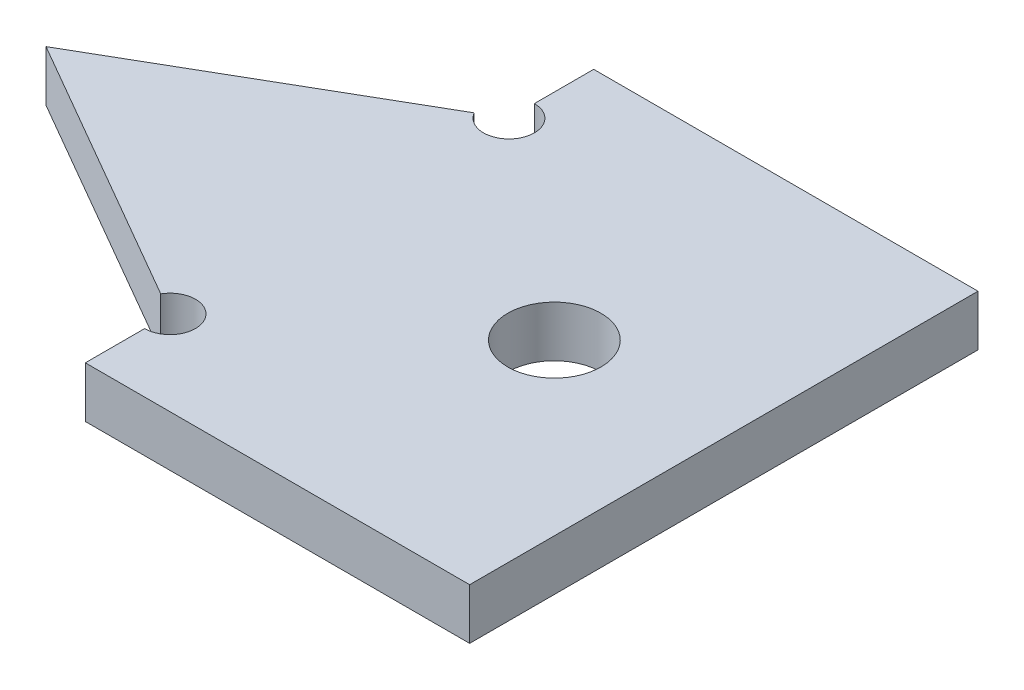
ISO-10303-21;
HEADER;
FILE_DESCRIPTION(('STEP AP214'),'2;1');
FILE_NAME('part.step','',(''),(''),'','','');
FILE_SCHEMA(('AUTOMOTIVE_DESIGN { 1 0 10303 214 1 1 1 1 }'));
ENDSEC;
DATA;
#1=APPLICATION_CONTEXT('core data for automotive mechanical design processes');
#2=APPLICATION_PROTOCOL_DEFINITION('international standard','automotive_design',2000,#1);
#3=PRODUCT_CONTEXT('',#1,'mechanical');
#4=PRODUCT('Part','Part','',(#3));
#5=PRODUCT_RELATED_PRODUCT_CATEGORY('part','',(#4));
#6=PRODUCT_DEFINITION_FORMATION('','',#4);
#7=PRODUCT_DEFINITION_CONTEXT('part definition',#1,'design');
#8=PRODUCT_DEFINITION('design','',#6,#7);
#9=PRODUCT_DEFINITION_SHAPE('','',#8);
#10=(LENGTH_UNIT() NAMED_UNIT(*) SI_UNIT(.MILLI.,.METRE.));
#11=(NAMED_UNIT(*) PLANE_ANGLE_UNIT() SI_UNIT($,.RADIAN.));
#12=(NAMED_UNIT(*) SI_UNIT($,.STERADIAN.) SOLID_ANGLE_UNIT());
#13=UNCERTAINTY_MEASURE_WITH_UNIT(LENGTH_MEASURE(1.E-05),#10,'distance_accuracy_value','');
#14=(GEOMETRIC_REPRESENTATION_CONTEXT(3) GLOBAL_UNCERTAINTY_ASSIGNED_CONTEXT((#13)) GLOBAL_UNIT_ASSIGNED_CONTEXT((#10,
#11,#12)) REPRESENTATION_CONTEXT('',''));
#15=CARTESIAN_POINT('',(0.,0.,0.));
#16=DIRECTION('',(0.,0.,1.));
#17=DIRECTION('',(1.,0.,0.));
#18=AXIS2_PLACEMENT_3D('',#15,#16,#17);
#19=CARTESIAN_POINT('',(17.3205080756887,3.,-25.));
#20=DIRECTION('',(0.,1.,0.));
#21=DIRECTION('',(0.,0.,1.));
#22=AXIS2_PLACEMENT_3D('',#19,#20,#21);
#23=PLANE('',#22);
#24=CARTESIAN_POINT('',(17.3205080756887,3.,-25.));
#25=DIRECTION('',(0.,-1.,0.));
#26=DIRECTION('',(0.,0.,1.));
#27=AXIS2_PLACEMENT_3D('',#24,#25,#26);
#28=CIRCLE('',#27,1.5);
#29=CARTESIAN_POINT('',(17.3205080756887,3.,-26.5));
#30=VERTEX_POINT('',#29);
#31=CARTESIAN_POINT('',(16.0214699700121,3.,-24.25));
#32=VERTEX_POINT('',#31);
#33=EDGE_CURVE('E140',#30,#32,#28,.T.);
#34=ORIENTED_EDGE('',*,*,#33,.T.);
#35=DIRECTION('',(-0.866025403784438,0.,0.500000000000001));
#36=VECTOR('',#35,1.);
#37=CARTESIAN_POINT('',(0.,3.,-15.));
#38=LINE('',#37,#36);
#39=CARTESIAN_POINT('',(0.,3.,-15.));
#40=VERTEX_POINT('',#39);
#41=EDGE_CURVE('E115',#32,#40,#38,.T.);
#42=ORIENTED_EDGE('',*,*,#41,.T.);
#43=DIRECTION('',(0.866025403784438,0.,0.500000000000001));
#44=VECTOR('',#43,1.);
#45=CARTESIAN_POINT('',(0.,3.,-15.));
#46=LINE('',#45,#44);
#47=CARTESIAN_POINT('',(16.0214699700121,3.,-5.75));
#48=VERTEX_POINT('',#47);
#49=EDGE_CURVE('E143',#40,#48,#46,.T.);
#50=ORIENTED_EDGE('',*,*,#49,.T.);
#51=CARTESIAN_POINT('',(17.3205080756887,3.,-5.));
#52=DIRECTION('',(0.,-1.,0.));
#53=DIRECTION('',(0.,0.,1.));
#54=AXIS2_PLACEMENT_3D('',#51,#52,#53);
#55=CIRCLE('',#54,1.5);
#56=CARTESIAN_POINT('',(17.3205080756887,3.,-3.5));
#57=VERTEX_POINT('',#56);
#58=EDGE_CURVE('E145',#48,#57,#55,.T.);
#59=ORIENTED_EDGE('',*,*,#58,.T.);
#60=DIRECTION('',(0.,0.,1.));
#61=VECTOR('',#60,1.);
#62=CARTESIAN_POINT('',(17.3205080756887,3.,-3.5));
#63=LINE('',#62,#61);
#64=CARTESIAN_POINT('',(17.3205080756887,3.,0.));
#65=VERTEX_POINT('',#64);
#66=EDGE_CURVE('E147',#57,#65,#63,.T.);
#67=ORIENTED_EDGE('',*,*,#66,.T.);
#68=DIRECTION('',(1.,0.,0.));
#69=VECTOR('',#68,1.);
#70=CARTESIAN_POINT('',(17.3205080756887,3.,0.));
#71=LINE('',#70,#69);
#72=CARTESIAN_POINT('',(40.,3.,0.));
#73=VERTEX_POINT('',#72);
#74=EDGE_CURVE('E149',#65,#73,#71,.T.);
#75=ORIENTED_EDGE('',*,*,#74,.T.);
#76=DIRECTION('',(0.,0.,-1.));
#77=VECTOR('',#76,1.);
#78=CARTESIAN_POINT('',(40.,3.,0.));
#79=LINE('',#78,#77);
#80=CARTESIAN_POINT('',(40.,3.,-30.));
#81=VERTEX_POINT('',#80);
#82=EDGE_CURVE('E151',#73,#81,#79,.T.);
#83=ORIENTED_EDGE('',*,*,#82,.T.);
#84=DIRECTION('',(-1.,0.,0.));
#85=VECTOR('',#84,1.);
#86=CARTESIAN_POINT('',(17.3205080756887,3.,-30.));
#87=LINE('',#86,#85);
#88=CARTESIAN_POINT('',(17.3205080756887,3.,-30.));
#89=VERTEX_POINT('',#88);
#90=EDGE_CURVE('E50',#81,#89,#87,.T.);
#91=ORIENTED_EDGE('',*,*,#90,.T.);
#92=DIRECTION('',(0.,0.,1.));
#93=VECTOR('',#92,1.);
#94=CARTESIAN_POINT('',(17.3205080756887,3.,-30.));
#95=LINE('',#94,#93);
#96=EDGE_CURVE('E45',#89,#30,#95,.T.);
#97=ORIENTED_EDGE('',*,*,#96,.T.);
#98=EDGE_LOOP('',(#34,#42,#50,#59,#67,#75,#83,#91,#97));
#99=FACE_BOUND('',#98,.T.);
#100=CARTESIAN_POINT('',(30.,3.,-15.));
#101=DIRECTION('',(0.,1.,0.));
#102=DIRECTION('',(0.,0.,1.));
#103=AXIS2_PLACEMENT_3D('',#100,#101,#102);
#104=CIRCLE('',#103,2.75);
#105=CARTESIAN_POINT('',(30.,3.,-12.25));
#106=VERTEX_POINT('',#105);
#107=EDGE_CURVE('E120',#106,#106,#104,.T.);
#108=ORIENTED_EDGE('',*,*,#107,.F.);
#109=EDGE_LOOP('',(#108));
#110=FACE_BOUND('',#109,.T.);
#111=ADVANCED_FACE('F30',(#99,#110),#23,.T.);
#112=CARTESIAN_POINT('',(17.3205080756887,0.,-25.));
#113=DIRECTION('',(0.,1.,0.));
#114=DIRECTION('',(0.,0.,1.));
#115=AXIS2_PLACEMENT_3D('',#112,#113,#114);
#116=PLANE('',#115);
#117=CARTESIAN_POINT('',(17.3205080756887,0.,-25.));
#118=DIRECTION('',(0.,-1.,0.));
#119=DIRECTION('',(0.,0.,1.));
#120=AXIS2_PLACEMENT_3D('',#117,#118,#119);
#121=CIRCLE('',#120,1.5);
#122=CARTESIAN_POINT('',(17.3205080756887,0.,-26.5));
#123=VERTEX_POINT('',#122);
#124=CARTESIAN_POINT('',(16.0214699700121,0.,-24.25));
#125=VERTEX_POINT('',#124);
#126=EDGE_CURVE('E106',#123,#125,#121,.T.);
#127=ORIENTED_EDGE('',*,*,#126,.F.);
#128=DIRECTION('',(0.,0.,1.));
#129=VECTOR('',#128,1.);
#130=CARTESIAN_POINT('',(17.3205080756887,0.,-30.));
#131=LINE('',#130,#129);
#132=CARTESIAN_POINT('',(17.3205080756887,0.,-30.));
#133=VERTEX_POINT('',#132);
#134=EDGE_CURVE('E138',#133,#123,#131,.T.);
#135=ORIENTED_EDGE('',*,*,#134,.F.);
#136=DIRECTION('',(-1.,0.,0.));
#137=VECTOR('',#136,1.);
#138=CARTESIAN_POINT('',(17.3205080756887,0.,-30.));
#139=LINE('',#138,#137);
#140=CARTESIAN_POINT('',(40.,0.,-30.));
#141=VERTEX_POINT('',#140);
#142=EDGE_CURVE('E136',#141,#133,#139,.T.);
#143=ORIENTED_EDGE('',*,*,#142,.F.);
#144=DIRECTION('',(0.,0.,-1.));
#145=VECTOR('',#144,1.);
#146=CARTESIAN_POINT('',(40.,0.,0.));
#147=LINE('',#146,#145);
#148=CARTESIAN_POINT('',(40.,0.,0.));
#149=VERTEX_POINT('',#148);
#150=EDGE_CURVE('E134',#149,#141,#147,.T.);
#151=ORIENTED_EDGE('',*,*,#150,.F.);
#152=DIRECTION('',(1.,0.,0.));
#153=VECTOR('',#152,1.);
#154=CARTESIAN_POINT('',(17.3205080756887,0.,0.));
#155=LINE('',#154,#153);
#156=CARTESIAN_POINT('',(17.3205080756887,0.,0.));
#157=VERTEX_POINT('',#156);
#158=EDGE_CURVE('E132',#157,#149,#155,.T.);
#159=ORIENTED_EDGE('',*,*,#158,.F.);
#160=DIRECTION('',(0.,0.,1.));
#161=VECTOR('',#160,1.);
#162=CARTESIAN_POINT('',(17.3205080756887,0.,-3.5));
#163=LINE('',#162,#161);
#164=CARTESIAN_POINT('',(17.3205080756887,0.,-3.5));
#165=VERTEX_POINT('',#164);
#166=EDGE_CURVE('E130',#165,#157,#163,.T.);
#167=ORIENTED_EDGE('',*,*,#166,.F.);
#168=CARTESIAN_POINT('',(17.3205080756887,0.,-5.));
#169=DIRECTION('',(0.,-1.,0.));
#170=DIRECTION('',(0.,0.,1.));
#171=AXIS2_PLACEMENT_3D('',#168,#169,#170);
#172=CIRCLE('',#171,1.5);
#173=CARTESIAN_POINT('',(16.0214699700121,0.,-5.75));
#174=VERTEX_POINT('',#173);
#175=EDGE_CURVE('E128',#174,#165,#172,.T.);
#176=ORIENTED_EDGE('',*,*,#175,.F.);
#177=DIRECTION('',(0.866025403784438,0.,0.500000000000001));
#178=VECTOR('',#177,1.);
#179=CARTESIAN_POINT('',(0.,0.,-15.));
#180=LINE('',#179,#178);
#181=CARTESIAN_POINT('',(0.,0.,-15.));
#182=VERTEX_POINT('',#181);
#183=EDGE_CURVE('E108',#182,#174,#180,.T.);
#184=ORIENTED_EDGE('',*,*,#183,.F.);
#185=DIRECTION('',(-0.866025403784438,0.,0.500000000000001));
#186=VECTOR('',#185,1.);
#187=CARTESIAN_POINT('',(0.,0.,-15.));
#188=LINE('',#187,#186);
#189=EDGE_CURVE('E101',#125,#182,#188,.T.);
#190=ORIENTED_EDGE('',*,*,#189,.F.);
#191=EDGE_LOOP('',(#127,#135,#143,#151,#159,#167,#176,#184,#190));
#192=FACE_BOUND('',#191,.T.);
#193=CARTESIAN_POINT('',(30.,0.,-15.));
#194=DIRECTION('',(0.,1.,0.));
#195=DIRECTION('',(0.,0.,1.));
#196=AXIS2_PLACEMENT_3D('',#193,#194,#195);
#197=CIRCLE('',#196,2.75);
#198=CARTESIAN_POINT('',(30.,0.,-12.25));
#199=VERTEX_POINT('',#198);
#200=EDGE_CURVE('E123',#199,#199,#197,.T.);
#201=ORIENTED_EDGE('',*,*,#200,.T.);
#202=EDGE_LOOP('',(#201));
#203=FACE_BOUND('',#202,.T.);
#204=ADVANCED_FACE('F102',(#192,#203),#116,.F.);
#205=CARTESIAN_POINT('',(17.3205080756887,3.,-25.));
#206=DIRECTION('',(0.,-1.,0.));
#207=DIRECTION('',(0.,0.,-1.));
#208=AXIS2_PLACEMENT_3D('',#205,#206,#207);
#209=CYLINDRICAL_SURFACE('',#208,1.5);
#210=ORIENTED_EDGE('',*,*,#126,.T.);
#211=DIRECTION('',(0.,-1.,0.));
#212=VECTOR('',#211,1.);
#213=CARTESIAN_POINT('',(16.0214699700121,3.,-24.25));
#214=LINE('',#213,#212);
#215=EDGE_CURVE('E11',#32,#125,#214,.T.);
#216=ORIENTED_EDGE('',*,*,#215,.F.);
#217=ORIENTED_EDGE('',*,*,#33,.F.);
#218=DIRECTION('',(0.,-1.,0.));
#219=VECTOR('',#218,1.);
#220=CARTESIAN_POINT('',(17.3205080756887,3.,-26.5));
#221=LINE('',#220,#219);
#222=EDGE_CURVE('E119',#30,#123,#221,.T.);
#223=ORIENTED_EDGE('',*,*,#222,.T.);
#224=EDGE_LOOP('',(#210,#216,#217,#223));
#225=FACE_BOUND('',#224,.T.);
#226=ADVANCED_FACE('F32',(#225),#209,.F.);
#227=CARTESIAN_POINT('',(0.,3.,-15.));
#228=DIRECTION('',(0.500000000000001,0.,0.866025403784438));
#229=DIRECTION('',(0.866025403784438,0.,-0.500000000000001));
#230=AXIS2_PLACEMENT_3D('',#227,#228,#229);
#231=PLANE('',#230);
#232=ORIENTED_EDGE('',*,*,#189,.T.);
#233=DIRECTION('',(0.,-1.,0.));
#234=VECTOR('',#233,1.);
#235=CARTESIAN_POINT('',(0.,3.,-15.));
#236=LINE('',#235,#234);
#237=EDGE_CURVE('E38',#40,#182,#236,.T.);
#238=ORIENTED_EDGE('',*,*,#237,.F.);
#239=ORIENTED_EDGE('',*,*,#41,.F.);
#240=ORIENTED_EDGE('',*,*,#215,.T.);
#241=EDGE_LOOP('',(#232,#238,#239,#240));
#242=FACE_BOUND('',#241,.T.);
#243=ADVANCED_FACE('F114',(#242),#231,.F.);
#244=CARTESIAN_POINT('',(0.,3.,-15.));
#245=DIRECTION('',(0.500000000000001,0.,-0.866025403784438));
#246=DIRECTION('',(-0.866025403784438,0.,-0.500000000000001));
#247=AXIS2_PLACEMENT_3D('',#244,#245,#246);
#248=PLANE('',#247);
#249=ORIENTED_EDGE('',*,*,#183,.T.);
#250=DIRECTION('',(0.,-1.,0.));
#251=VECTOR('',#250,1.);
#252=CARTESIAN_POINT('',(16.0214699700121,3.,-5.75));
#253=LINE('',#252,#251);
#254=EDGE_CURVE('E171',#48,#174,#253,.T.);
#255=ORIENTED_EDGE('',*,*,#254,.F.);
#256=ORIENTED_EDGE('',*,*,#49,.F.);
#257=ORIENTED_EDGE('',*,*,#237,.T.);
#258=EDGE_LOOP('',(#249,#255,#256,#257));
#259=FACE_BOUND('',#258,.T.);
#260=ADVANCED_FACE('F175',(#259),#248,.F.);
#261=CARTESIAN_POINT('',(17.3205080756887,3.,-5.));
#262=DIRECTION('',(0.,-1.,0.));
#263=DIRECTION('',(0.,0.,-1.));
#264=AXIS2_PLACEMENT_3D('',#261,#262,#263);
#265=CYLINDRICAL_SURFACE('',#264,1.5);
#266=ORIENTED_EDGE('',*,*,#175,.T.);
#267=DIRECTION('',(0.,-1.,0.));
#268=VECTOR('',#267,1.);
#269=CARTESIAN_POINT('',(17.3205080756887,3.,-3.5));
#270=LINE('',#269,#268);
#271=EDGE_CURVE('E168',#57,#165,#270,.T.);
#272=ORIENTED_EDGE('',*,*,#271,.F.);
#273=ORIENTED_EDGE('',*,*,#58,.F.);
#274=ORIENTED_EDGE('',*,*,#254,.T.);
#275=EDGE_LOOP('',(#266,#272,#273,#274));
#276=FACE_BOUND('',#275,.T.);
#277=ADVANCED_FACE('F183',(#276),#265,.F.);
#278=CARTESIAN_POINT('',(17.3205080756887,3.,-3.5));
#279=DIRECTION('',(1.,0.,0.));
#280=DIRECTION('',(0.,0.,-1.));
#281=AXIS2_PLACEMENT_3D('',#278,#279,#280);
#282=PLANE('',#281);
#283=ORIENTED_EDGE('',*,*,#166,.T.);
#284=DIRECTION('',(0.,-1.,0.));
#285=VECTOR('',#284,1.);
#286=CARTESIAN_POINT('',(17.3205080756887,3.,0.));
#287=LINE('',#286,#285);
#288=EDGE_CURVE('E165',#65,#157,#287,.T.);
#289=ORIENTED_EDGE('',*,*,#288,.F.);
#290=ORIENTED_EDGE('',*,*,#66,.F.);
#291=ORIENTED_EDGE('',*,*,#271,.T.);
#292=EDGE_LOOP('',(#283,#289,#290,#291));
#293=FACE_BOUND('',#292,.T.);
#294=ADVANCED_FACE('F186',(#293),#282,.F.);
#295=CARTESIAN_POINT('',(17.3205080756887,3.,0.));
#296=DIRECTION('',(0.,0.,-1.));
#297=DIRECTION('',(-1.,0.,0.));
#298=AXIS2_PLACEMENT_3D('',#295,#296,#297);
#299=PLANE('',#298);
#300=ORIENTED_EDGE('',*,*,#158,.T.);
#301=DIRECTION('',(0.,-1.,0.));
#302=VECTOR('',#301,1.);
#303=CARTESIAN_POINT('',(40.,3.,0.));
#304=LINE('',#303,#302);
#305=EDGE_CURVE('E162',#73,#149,#304,.T.);
#306=ORIENTED_EDGE('',*,*,#305,.F.);
#307=ORIENTED_EDGE('',*,*,#74,.F.);
#308=ORIENTED_EDGE('',*,*,#288,.T.);
#309=EDGE_LOOP('',(#300,#306,#307,#308));
#310=FACE_BOUND('',#309,.T.);
#311=ADVANCED_FACE('F191',(#310),#299,.F.);
#312=CARTESIAN_POINT('',(40.,3.,0.));
#313=DIRECTION('',(-1.,0.,0.));
#314=DIRECTION('',(0.,0.,1.));
#315=AXIS2_PLACEMENT_3D('',#312,#313,#314);
#316=PLANE('',#315);
#317=ORIENTED_EDGE('',*,*,#150,.T.);
#318=DIRECTION('',(0.,-1.,0.));
#319=VECTOR('',#318,1.);
#320=CARTESIAN_POINT('',(40.,3.,-30.));
#321=LINE('',#320,#319);
#322=EDGE_CURVE('E159',#81,#141,#321,.T.);
#323=ORIENTED_EDGE('',*,*,#322,.F.);
#324=ORIENTED_EDGE('',*,*,#82,.F.);
#325=ORIENTED_EDGE('',*,*,#305,.T.);
#326=EDGE_LOOP('',(#317,#323,#324,#325));
#327=FACE_BOUND('',#326,.T.);
#328=ADVANCED_FACE('F195',(#327),#316,.F.);
#329=CARTESIAN_POINT('',(17.3205080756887,3.,-30.));
#330=DIRECTION('',(0.,0.,1.));
#331=DIRECTION('',(1.,0.,0.));
#332=AXIS2_PLACEMENT_3D('',#329,#330,#331);
#333=PLANE('',#332);
#334=ORIENTED_EDGE('',*,*,#142,.T.);
#335=DIRECTION('',(0.,-1.,0.));
#336=VECTOR('',#335,1.);
#337=CARTESIAN_POINT('',(17.3205080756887,3.,-30.));
#338=LINE('',#337,#336);
#339=EDGE_CURVE('E156',#89,#133,#338,.T.);
#340=ORIENTED_EDGE('',*,*,#339,.F.);
#341=ORIENTED_EDGE('',*,*,#90,.F.);
#342=ORIENTED_EDGE('',*,*,#322,.T.);
#343=EDGE_LOOP('',(#334,#340,#341,#342));
#344=FACE_BOUND('',#343,.T.);
#345=ADVANCED_FACE('F199',(#344),#333,.F.);
#346=CARTESIAN_POINT('',(17.3205080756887,3.,-30.));
#347=DIRECTION('',(1.,0.,0.));
#348=DIRECTION('',(0.,0.,-1.));
#349=AXIS2_PLACEMENT_3D('',#346,#347,#348);
#350=PLANE('',#349);
#351=ORIENTED_EDGE('',*,*,#134,.T.);
#352=ORIENTED_EDGE('',*,*,#222,.F.);
#353=ORIENTED_EDGE('',*,*,#96,.F.);
#354=ORIENTED_EDGE('',*,*,#339,.T.);
#355=EDGE_LOOP('',(#351,#352,#353,#354));
#356=FACE_BOUND('',#355,.T.);
#357=ADVANCED_FACE('F201',(#356),#350,.F.);
#358=CARTESIAN_POINT('',(30.,3.,-15.));
#359=DIRECTION('',(0.,-1.,0.));
#360=DIRECTION('',(0.,0.,-1.));
#361=AXIS2_PLACEMENT_3D('',#358,#359,#360);
#362=CYLINDRICAL_SURFACE('',#361,2.75);
#363=ORIENTED_EDGE('',*,*,#107,.T.);
#364=EDGE_LOOP('',(#363));
#365=FACE_BOUND('',#364,.T.);
#366=ORIENTED_EDGE('',*,*,#200,.F.);
#367=EDGE_LOOP('',(#366));
#368=FACE_BOUND('',#367,.T.);
#369=ADVANCED_FACE('F203',(#365,#368),#362,.F.);
#370=CLOSED_SHELL('',(#111,#204,#226,#243,#260,#277,#294,#311,#328,#345,#357,#369));
#371=MANIFOLD_SOLID_BREP('B2',#370);
#372=ADVANCED_BREP_SHAPE_REPRESENTATION('',(#18,#371),#14);
#373=SHAPE_DEFINITION_REPRESENTATION(#9,#372);
ENDSEC;
END-ISO-10303-21;
